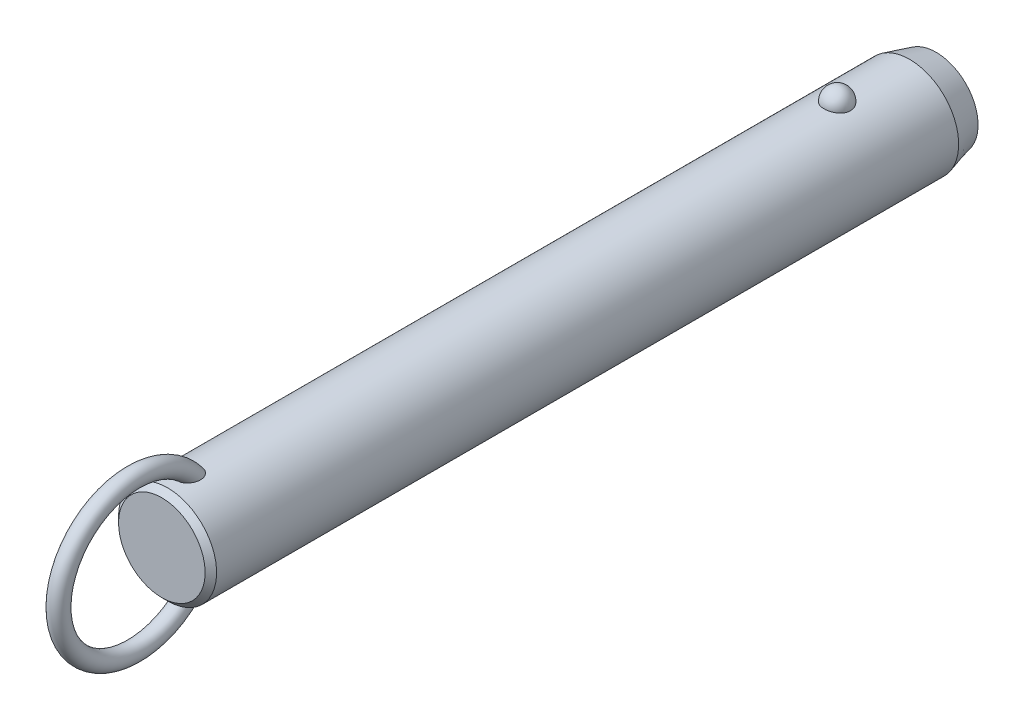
ISO-10303-21;
HEADER;
FILE_DESCRIPTION(('STEP AP214'),'2;1');
FILE_NAME('part.step','',(''),(''),'','','');
FILE_SCHEMA(('AUTOMOTIVE_DESIGN { 1 0 10303 214 1 1 1 1 }'));
ENDSEC;
DATA;
#1=APPLICATION_CONTEXT('core data for automotive mechanical design processes');
#2=APPLICATION_PROTOCOL_DEFINITION('international standard','automotive_design',2000,#1);
#3=PRODUCT_CONTEXT('',#1,'mechanical');
#4=PRODUCT('Part','Part','',(#3));
#5=PRODUCT_RELATED_PRODUCT_CATEGORY('part','',(#4));
#6=PRODUCT_DEFINITION_FORMATION('','',#4);
#7=PRODUCT_DEFINITION_CONTEXT('part definition',#1,'design');
#8=PRODUCT_DEFINITION('design','',#6,#7);
#9=PRODUCT_DEFINITION_SHAPE('','',#8);
#10=(LENGTH_UNIT() NAMED_UNIT(*) SI_UNIT(.MILLI.,.METRE.));
#11=(NAMED_UNIT(*) PLANE_ANGLE_UNIT() SI_UNIT($,.RADIAN.));
#12=(NAMED_UNIT(*) SI_UNIT($,.STERADIAN.) SOLID_ANGLE_UNIT());
#13=UNCERTAINTY_MEASURE_WITH_UNIT(LENGTH_MEASURE(1.E-05),#10,'distance_accuracy_value','');
#14=(GEOMETRIC_REPRESENTATION_CONTEXT(3) GLOBAL_UNCERTAINTY_ASSIGNED_CONTEXT((#13)) GLOBAL_UNIT_ASSIGNED_CONTEXT((#10,
#11,#12)) REPRESENTATION_CONTEXT('',''));
#15=CARTESIAN_POINT('',(0.,0.,0.));
#16=DIRECTION('',(0.,0.,1.));
#17=DIRECTION('',(1.,0.,0.));
#18=AXIS2_PLACEMENT_3D('',#15,#16,#17);
#19=CARTESIAN_POINT('',(0.,0.,137.2));
#20=DIRECTION('',(0.,0.,-1.));
#21=DIRECTION('',(-1.,0.,0.));
#22=AXIS2_PLACEMENT_3D('',#19,#20,#21);
#23=CYLINDRICAL_SURFACE('',#22,11.1);
#24=CARTESIAN_POINT('',(2.9724815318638,10.6945945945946,-3.));
#25=CARTESIAN_POINT('',(2.97247830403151,10.6945972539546,-2.83225059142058));
#26=CARTESIAN_POINT('',(2.95876598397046,10.6984356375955,-2.66445972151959));
#27=CARTESIAN_POINT('',(2.90424529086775,10.7133624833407,-2.33362381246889));
#28=CARTESIAN_POINT('',(2.8634252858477,10.7244540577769,-2.1705808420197));
#29=CARTESIAN_POINT('',(2.75573657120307,10.7526272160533,-1.85396767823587));
#30=CARTESIAN_POINT('',(2.68887937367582,10.7697061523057,-1.70039333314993));
#31=CARTESIAN_POINT('',(2.53079696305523,10.8079438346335,-1.40691598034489));
#32=CARTESIAN_POINT('',(2.43957264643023,10.8291024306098,-1.2670124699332));
#33=CARTESIAN_POINT('',(2.23458150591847,10.8732541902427,-1.00409565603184));
#34=CARTESIAN_POINT('',(2.12071295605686,10.8962553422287,-0.881162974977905));
#35=CARTESIAN_POINT('',(1.87365402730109,10.9414421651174,-0.656352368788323));
#36=CARTESIAN_POINT('',(1.74046358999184,10.9636278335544,-0.554474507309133));
#37=CARTESIAN_POINT('',(1.45872188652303,11.0046495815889,-0.374872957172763));
#38=CARTESIAN_POINT('',(1.31021276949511,11.0234944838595,-0.297085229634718));
#39=CARTESIAN_POINT('',(1.00170030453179,11.0557957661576,-0.167529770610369));
#40=CARTESIAN_POINT('',(0.841698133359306,11.0692526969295,-0.115759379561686));
#41=CARTESIAN_POINT('',(0.517607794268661,11.0890932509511,-0.0403925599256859));
#42=CARTESIAN_POINT('',(0.353633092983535,11.0955916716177,-0.0163383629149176));
#43=CARTESIAN_POINT('',(0.0238420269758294,11.1011989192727,0.0044517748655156));
#44=CARTESIAN_POINT('',(-0.141974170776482,11.1003084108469,0.00119017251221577));
#45=CARTESIAN_POINT('',(-0.468405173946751,11.0912990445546,-0.0323233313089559));
#46=CARTESIAN_POINT('',(-0.629059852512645,11.0832767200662,-0.0622147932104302));
#47=CARTESIAN_POINT('',(-0.942937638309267,11.0609962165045,-0.147645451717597));
#48=CARTESIAN_POINT('',(-1.09616062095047,11.0467379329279,-0.203185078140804));
#49=CARTESIAN_POINT('',(-1.39181061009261,11.0134071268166,-0.3387529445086));
#50=CARTESIAN_POINT('',(-1.53417383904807,10.9943086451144,-0.418913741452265));
#51=CARTESIAN_POINT('',(-1.80342160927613,10.9533667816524,-0.60144882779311));
#52=CARTESIAN_POINT('',(-1.9303046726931,10.9315231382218,-0.703825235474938));
#53=CARTESIAN_POINT('',(-2.16747598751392,10.887005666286,-0.930091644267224));
#54=CARTESIAN_POINT('',(-2.27742774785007,10.8643239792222,-1.05433291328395));
#55=CARTESIAN_POINT('',(-2.47517316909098,10.8209886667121,-1.31966633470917));
#56=CARTESIAN_POINT('',(-2.56296538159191,10.8003351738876,-1.46075958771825));
#57=CARTESIAN_POINT('',(-2.71500300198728,10.7631304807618,-1.75753646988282));
#58=CARTESIAN_POINT('',(-2.77898901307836,10.7466250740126,-1.91335887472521));
#59=CARTESIAN_POINT('',(-2.88046189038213,10.7198747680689,-2.2339152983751));
#60=CARTESIAN_POINT('',(-2.91794947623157,10.709629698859,-2.39864907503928));
#61=CARTESIAN_POINT('',(-2.96537819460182,10.6965949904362,-2.73165170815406));
#62=CARTESIAN_POINT('',(-2.97542891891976,10.693775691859,-2.89990378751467));
#63=CARTESIAN_POINT('',(-2.96804271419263,10.6958279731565,-3.235752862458));
#64=CARTESIAN_POINT('',(-2.95060646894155,10.7006993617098,-3.40334987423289));
#65=CARTESIAN_POINT('',(-2.88883358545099,10.71753912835,-3.73233906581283));
#66=CARTESIAN_POINT('',(-2.84462026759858,10.7294749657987,-3.89375610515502));
#67=CARTESIAN_POINT('',(-2.73050447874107,10.7590797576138,-4.20667949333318));
#68=CARTESIAN_POINT('',(-2.66060103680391,10.7767489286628,-4.35818546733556));
#69=CARTESIAN_POINT('',(-2.49642559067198,10.8159599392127,-4.6478542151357));
#70=CARTESIAN_POINT('',(-2.40203047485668,10.8375211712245,-4.78594458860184));
#71=CARTESIAN_POINT('',(-2.19143488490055,10.8820570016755,-5.0441038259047));
#72=CARTESIAN_POINT('',(-2.07523364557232,10.9050316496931,-5.16417205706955));
#73=CARTESIAN_POINT('',(-1.82361254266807,10.9499219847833,-5.38334833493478));
#74=CARTESIAN_POINT('',(-1.68812945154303,10.9718338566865,-5.48238464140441));
#75=CARTESIAN_POINT('',(-1.40191298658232,11.0120611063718,-5.65618873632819));
#76=CARTESIAN_POINT('',(-1.25118062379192,11.0303767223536,-5.73095813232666));
#77=CARTESIAN_POINT('',(-0.940570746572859,11.0611653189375,-5.85334725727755));
#78=CARTESIAN_POINT('',(-0.780821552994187,11.0737044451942,-5.90127578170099));
#79=CARTESIAN_POINT('',(-0.455204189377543,11.0918598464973,-5.96992976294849));
#80=CARTESIAN_POINT('',(-0.289336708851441,11.0974768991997,-5.99065827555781));
#81=CARTESIAN_POINT('',(0.0406846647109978,11.1011307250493,-6.00418773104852));
#82=CARTESIAN_POINT('',(0.204817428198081,11.099299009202,-5.99747318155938));
#83=CARTESIAN_POINT('',(0.5295530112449,11.088551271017,-5.9574031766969));
#84=CARTESIAN_POINT('',(0.69015594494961,11.0796354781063,-5.92404858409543));
#85=CARTESIAN_POINT('',(1.0027760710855,11.0557204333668,-5.83180084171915));
#86=CARTESIAN_POINT('',(1.15482001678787,11.0407414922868,-5.77299291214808));
#87=CARTESIAN_POINT('',(1.44678373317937,11.0062913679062,-5.63147366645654));
#88=CARTESIAN_POINT('',(1.58670279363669,10.9868199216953,-5.54876095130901));
#89=CARTESIAN_POINT('',(1.8527023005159,10.9451315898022,-5.36027644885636));
#90=CARTESIAN_POINT('',(1.97855158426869,10.9228788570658,-5.25418644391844));
#91=CARTESIAN_POINT('',(2.21080872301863,10.8782509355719,-5.02251354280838));
#92=CARTESIAN_POINT('',(2.31721312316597,10.8558757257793,-4.89692718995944));
#93=CARTESIAN_POINT('',(2.5094551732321,10.8130715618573,-4.62745408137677));
#94=CARTESIAN_POINT('',(2.59493284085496,10.7926798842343,-4.48330448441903));
#95=CARTESIAN_POINT('',(2.740862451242,10.7565495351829,-4.18236358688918));
#96=CARTESIAN_POINT('',(2.80132490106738,10.7408089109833,-4.02557762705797));
#97=CARTESIAN_POINT('',(2.88959070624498,10.7173718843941,-3.72475308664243));
#98=CARTESIAN_POINT('',(2.92062102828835,10.7088950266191,-3.58171216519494));
#99=CARTESIAN_POINT('',(2.96206765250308,10.6975052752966,-3.29245795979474));
#100=CARTESIAN_POINT('',(2.97248434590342,10.6945922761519,-3.14624473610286));
#101=CARTESIAN_POINT('',(2.9724815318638,10.6945945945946,-3.));
#102=B_SPLINE_CURVE_WITH_KNOTS('',3,(#24,#25,#26,#27,#28,#29,#30,#31,#32,#33,#34,#35,#36,#37,
#38,#39,#40,#41,#42,#43,#44,#45,#46,#47,#48,#49,#50,#51,#52,#53,#54,#55,#56,#57,#58,#59,#60,#61,
#62,#63,#64,#65,#66,#67,#68,#69,#70,#71,#72,#73,#74,#75,#76,#77,#78,#79,#80,#81,#82,#83,#84,#85,
#86,#87,#88,#89,#90,#91,#92,#93,#94,#95,#96,#97,#98,#99,#100,#101),.UNSPECIFIED.,.T.,.F.,(4,2,2,
2,2,2,2,2,2,2,2,2,2,2,2,2,2,2,2,2,2,2,2,2,2,2,2,2,2,2,2,2,2,2,2,2,2,2,4),(0.,0.502722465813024,
1.00566079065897,1.5083769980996,2.01107471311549,2.51608392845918,3.02109467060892,
3.52475118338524,4.02835620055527,4.523518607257,5.0186364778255,5.50715297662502,
5.9956776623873,6.48688002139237,6.97812923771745,7.47814366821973,7.9781907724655,
8.48353712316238,8.9888697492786,9.49218093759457,9.99547960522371,10.4964777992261,
10.997494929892,11.5010810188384,12.0046847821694,12.5099796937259,13.0152411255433,
13.5145635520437,14.0138298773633,14.5043200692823,14.9947943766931,15.4836390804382,
15.9725123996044,16.4685040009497,16.9645836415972,17.4686765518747,17.972557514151,
18.410841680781,18.849117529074),.UNSPECIFIED.);
#103=CARTESIAN_POINT('',(2.9724815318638,10.6945945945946,-3.));
#104=VERTEX_POINT('',#103);
#105=EDGE_CURVE('E41',#104,#104,#102,.T.);
#106=ORIENTED_EDGE('',*,*,#105,.T.);
#107=EDGE_LOOP('',(#106));
#108=FACE_BOUND('',#107,.T.);
#109=CARTESIAN_POINT('',(0.,0.,148.6));
#110=DIRECTION('',(0.,0.,1.));
#111=DIRECTION('',(1.,0.,0.));
#112=AXIS2_PLACEMENT_3D('',#109,#110,#111);
#113=CIRCLE('',#112,11.1);
#114=CARTESIAN_POINT('',(-11.1,0.,148.6));
#115=VERTEX_POINT('',#114);
#116=EDGE_CURVE('E10',#115,#115,#113,.F.);
#117=ORIENTED_EDGE('',*,*,#116,.T.);
#118=EDGE_LOOP('',(#117));
#119=FACE_BOUND('',#118,.T.);
#120=CARTESIAN_POINT('',(-0.564520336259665,-11.0856356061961,140.857815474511));
#121=CARTESIAN_POINT('',(-0.667202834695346,-11.0804062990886,140.891283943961));
#122=CARTESIAN_POINT('',(-0.766875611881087,-11.0738877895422,140.933835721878));
#123=CARTESIAN_POINT('',(-0.95728412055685,-11.0590576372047,141.035419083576));
#124=CARTESIAN_POINT('',(-1.04801616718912,-11.0507452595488,141.09445742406));
#125=CARTESIAN_POINT('',(-1.21800952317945,-11.0333016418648,141.226529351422));
#126=CARTESIAN_POINT('',(-1.2973080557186,-11.0241732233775,141.299515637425));
#127=CARTESIAN_POINT('',(-1.44337665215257,-11.0060026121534,141.457037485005));
#128=CARTESIAN_POINT('',(-1.51014622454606,-10.9969604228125,141.541573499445));
#129=CARTESIAN_POINT('',(-1.63454620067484,-10.9791841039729,141.725521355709));
#130=CARTESIAN_POINT('',(-1.69127003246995,-10.9705107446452,141.825549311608));
#131=CARTESIAN_POINT('',(-1.7898078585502,-10.9548648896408,142.032790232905));
#132=CARTESIAN_POINT('',(-1.83161214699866,-10.9478935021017,142.140007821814));
#133=CARTESIAN_POINT('',(-1.91557028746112,-10.9335803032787,142.405408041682));
#134=CARTESIAN_POINT('',(-1.95040620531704,-10.9273269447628,142.565980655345));
#135=CARTESIAN_POINT('',(-1.99388326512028,-10.9194709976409,142.890697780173));
#136=CARTESIAN_POINT('',(-2.00248051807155,-10.9178762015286,143.054847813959));
#137=CARTESIAN_POINT('',(-1.99551615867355,-10.9191578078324,143.424650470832));
#138=CARTESIAN_POINT('',(-1.9732206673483,-10.9232807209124,143.630191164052));
#139=CARTESIAN_POINT('',(-1.9152976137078,-10.9335244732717,143.933595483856));
#140=CARTESIAN_POINT('',(-1.89184575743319,-10.9376266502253,144.034088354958));
#141=CARTESIAN_POINT('',(-1.83700674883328,-10.9469720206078,144.232855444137));
#142=CARTESIAN_POINT('',(-1.80562070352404,-10.9522150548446,144.331129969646));
#143=CARTESIAN_POINT('',(-1.73463055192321,-10.9636837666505,144.525914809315));
#144=CARTESIAN_POINT('',(-1.69493416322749,-10.9699202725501,144.622390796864));
#145=CARTESIAN_POINT('',(-1.60745141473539,-10.9830806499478,144.811626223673));
#146=CARTESIAN_POINT('',(-1.55966150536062,-10.9900048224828,144.904384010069));
#147=CARTESIAN_POINT('',(-1.45591812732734,-11.0042280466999,145.084690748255));
#148=CARTESIAN_POINT('',(-1.40000013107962,-11.0115253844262,145.172260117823));
#149=CARTESIAN_POINT('',(-1.27937470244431,-11.0261911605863,145.341029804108));
#150=CARTESIAN_POINT('',(-1.21467835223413,-11.0335594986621,145.42223795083));
#151=CARTESIAN_POINT('',(-1.08218150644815,-11.0473027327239,145.569001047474));
#152=CARTESIAN_POINT('',(-1.01522633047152,-11.0537063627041,145.635309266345));
#153=CARTESIAN_POINT('',(-0.872952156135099,-11.065850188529,145.758378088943));
#154=CARTESIAN_POINT('',(-0.797642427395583,-11.0715911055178,145.815149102));
#155=CARTESIAN_POINT('',(-0.651396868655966,-11.081071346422,145.907515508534));
#156=CARTESIAN_POINT('',(-0.581712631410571,-11.0849841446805,145.945049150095));
#157=CARTESIAN_POINT('',(-0.437066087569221,-11.0916271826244,146.008259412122));
#158=CARTESIAN_POINT('',(-0.362109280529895,-11.0943586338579,146.033948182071));
#159=CARTESIAN_POINT('',(-0.207828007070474,-11.0983242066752,146.071117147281));
#160=CARTESIAN_POINT('',(-0.12846771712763,-11.0995432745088,146.082454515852));
#161=CARTESIAN_POINT('',(0.0309101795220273,-11.1002423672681,146.088965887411));
#162=CARTESIAN_POINT('',(0.110927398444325,-11.0997233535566,146.084148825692));
#163=CARTESIAN_POINT('',(0.25640659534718,-11.097240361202,146.060959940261));
#164=CARTESIAN_POINT('',(0.322235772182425,-11.0955074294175,146.044754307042));
#165=CARTESIAN_POINT('',(0.450635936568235,-11.0910350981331,146.002600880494));
#166=CARTESIAN_POINT('',(0.513205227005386,-11.0882951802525,145.976648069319));
#167=CARTESIAN_POINT('',(0.662626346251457,-11.0805620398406,145.902607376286));
#168=CARTESIAN_POINT('',(0.747127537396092,-11.0751144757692,145.849845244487));
#169=CARTESIAN_POINT('',(0.906756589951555,-11.0631932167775,145.731720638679));
#170=CARTESIAN_POINT('',(0.981859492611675,-11.0567168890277,145.666325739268));
#171=CARTESIAN_POINT('',(1.10712207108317,-11.0447856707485,145.54226337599));
#172=CARTESIAN_POINT('',(1.15909566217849,-11.0394280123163,145.485383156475));
#173=CARTESIAN_POINT('',(1.2579192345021,-11.0286040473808,145.367327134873));
#174=CARTESIAN_POINT('',(1.30476642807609,-11.0231376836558,145.306149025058));
#175=CARTESIAN_POINT('',(1.43818612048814,-11.0068027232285,145.117305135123));
#176=CARTESIAN_POINT('',(1.51751767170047,-10.9960104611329,144.984453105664));
#177=CARTESIAN_POINT('',(1.63597546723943,-10.9788847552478,144.753137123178));
#178=CARTESIAN_POINT('',(1.67988876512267,-10.9722190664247,144.657053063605));
#179=CARTESIAN_POINT('',(1.75953241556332,-10.9597298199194,144.461431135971));
#180=CARTESIAN_POINT('',(1.7952596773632,-10.9539065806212,144.361891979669));
#181=CARTESIAN_POINT('',(1.85844731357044,-10.9433632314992,144.16021118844));
#182=CARTESIAN_POINT('',(1.88591073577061,-10.9386427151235,144.05807052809));
#183=CARTESIAN_POINT('',(1.93234324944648,-10.9305350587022,143.851819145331));
#184=CARTESIAN_POINT('',(1.95131065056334,-10.9271481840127,143.747708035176));
#185=CARTESIAN_POINT('',(1.9904020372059,-10.9201183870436,143.465458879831));
#186=CARTESIAN_POINT('',(2.00221217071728,-10.9179256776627,143.286037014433));
#187=CARTESIAN_POINT('',(1.99711676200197,-10.9188636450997,142.927713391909));
#188=CARTESIAN_POINT('',(1.98026150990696,-10.9219849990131,142.748811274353));
#189=CARTESIAN_POINT('',(1.92151657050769,-10.9324473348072,142.43645144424));
#190=CARTESIAN_POINT('',(1.88605081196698,-10.9386915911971,142.301759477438));
#191=CARTESIAN_POINT('',(1.79393020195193,-10.9541780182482,142.039966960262));
#192=CARTESIAN_POINT('',(1.73729868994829,-10.9634168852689,141.912858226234));
#193=CARTESIAN_POINT('',(1.61237037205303,-10.9824218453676,141.689418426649));
#194=CARTESIAN_POINT('',(1.54715374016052,-10.9918945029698,141.591345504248));
#195=CARTESIAN_POINT('',(1.40127026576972,-11.0114415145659,141.407434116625));
#196=CARTESIAN_POINT('',(1.32060742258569,-11.0215157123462,141.321592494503));
#197=CARTESIAN_POINT('',(1.1447478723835,-11.041168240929,141.165163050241));
#198=CARTESIAN_POINT('',(1.04947805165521,-11.0507437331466,141.094656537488));
#199=CARTESIAN_POINT('',(0.847278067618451,-11.0680789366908,140.972640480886));
#200=CARTESIAN_POINT('',(0.740351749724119,-11.0758392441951,140.921124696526));
#201=CARTESIAN_POINT('',(0.529289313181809,-11.0878275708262,140.843485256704));
#202=CARTESIAN_POINT('',(0.425895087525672,-11.0923259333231,140.815377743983));
#203=CARTESIAN_POINT('',(0.215723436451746,-11.0984001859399,140.777703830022));
#204=CARTESIAN_POINT('',(0.10894793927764,-11.0999777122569,140.768127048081));
#205=CARTESIAN_POINT('',(-0.0938962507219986,-11.1000196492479,140.767877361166));
#206=CARTESIAN_POINT('',(-0.189967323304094,-11.0987797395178,140.775408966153));
#207=CARTESIAN_POINT('',(-0.379657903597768,-11.0939111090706,140.805507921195));
#208=CARTESIAN_POINT('',(-0.47327735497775,-11.0902823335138,140.828075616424));
#209=CARTESIAN_POINT('',(-0.564520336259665,-11.0856356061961,140.857815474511));
#210=B_SPLINE_CURVE_WITH_KNOTS('',3,(#120,#121,#122,#123,#124,#125,#126,#127,#128,#129,#130,
#131,#132,#133,#134,#135,#136,#137,#138,#139,#140,#141,#142,#143,#144,#145,#146,#147,#148,#149,
#150,#151,#152,#153,#154,#155,#156,#157,#158,#159,#160,#161,#162,#163,#164,#165,#166,#167,#168,
#169,#170,#171,#172,#173,#174,#175,#176,#177,#178,#179,#180,#181,#182,#183,#184,#185,#186,#187,
#188,#189,#190,#191,#192,#193,#194,#195,#196,#197,#198,#199,#200,#201,#202,#203,#204,#205,#206,
#207,#208,#209),.UNSPECIFIED.,.T.,.F.,(4,2,2,2,2,2,2,2,2,2,2,2,2,2,2,2,2,2,2,2,2,2,2,2,2,2,2,2,
2,2,2,2,2,2,2,2,2,2,2,2,2,2,2,2,4),(0.,0.323999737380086,0.64813245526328,0.971184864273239,
1.29424994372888,1.63886237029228,1.98369857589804,2.47426059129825,2.96564271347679,
3.58257396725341,3.89215258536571,4.20168803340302,4.51486273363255,4.82817514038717,
5.14015911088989,5.45175282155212,5.73442856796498,6.01679375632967,6.2536458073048,
6.49025437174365,6.72919963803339,6.96801276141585,7.17061258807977,7.37331685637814,
7.67094989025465,7.96935728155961,8.20075067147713,8.43226927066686,8.89581623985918,
9.21306533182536,9.53043400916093,9.84768549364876,10.1650000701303,10.7022930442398,
11.2386443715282,11.655339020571,12.071575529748,12.4245637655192,12.7774607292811,
13.1321855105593,13.4867936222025,13.8068771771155,14.1267813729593,14.4146787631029,
14.7025827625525),.UNSPECIFIED.);
#211=CARTESIAN_POINT('',(-0.564520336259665,-11.0856356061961,140.857815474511));
#212=VERTEX_POINT('',#211);
#213=EDGE_CURVE('E60',#212,#212,#210,.T.);
#214=ORIENTED_EDGE('',*,*,#213,.T.);
#215=EDGE_LOOP('',(#214));
#216=FACE_BOUND('',#215,.T.);
#217=CARTESIAN_POINT('',(-0.564520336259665,11.0856356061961,140.857815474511));
#218=CARTESIAN_POINT('',(-0.468542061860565,11.0905203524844,140.826545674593));
#219=CARTESIAN_POINT('',(-0.369793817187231,11.0942886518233,140.803157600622));
#220=CARTESIAN_POINT('',(-0.169555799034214,11.0991586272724,140.773085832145));
#221=CARTESIAN_POINT('',(-0.0680604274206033,11.1002543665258,140.76643932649));
#222=CARTESIAN_POINT('',(0.134549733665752,11.099646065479,140.770157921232));
#223=CARTESIAN_POINT('',(0.235664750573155,11.0979441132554,140.78051033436));
#224=CARTESIAN_POINT('',(0.434632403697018,11.0919342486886,140.817831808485));
#225=CARTESIAN_POINT('',(0.532486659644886,11.0876276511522,140.844792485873));
#226=CARTESIAN_POINT('',(0.722445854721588,11.0768742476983,140.9144096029));
#227=CARTESIAN_POINT('',(0.814543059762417,11.0704246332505,140.957086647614));
#228=CARTESIAN_POINT('',(0.990565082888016,11.0560659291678,141.056648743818));
#229=CARTESIAN_POINT('',(1.07448844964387,11.048156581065,141.113536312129));
#230=CARTESIAN_POINT('',(1.23562672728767,11.0313221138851,141.242210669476));
#231=CARTESIAN_POINT('',(1.3124268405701,11.0223686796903,141.314511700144));
#232=CARTESIAN_POINT('',(1.45398030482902,11.0045918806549,141.470042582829));
#233=CARTESIAN_POINT('',(1.51873073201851,10.9957685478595,141.553275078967));
#234=CARTESIAN_POINT('',(1.64107232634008,10.9782087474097,141.736384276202));
#235=CARTESIAN_POINT('',(1.6974317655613,10.9695572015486,141.837089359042));
#236=CARTESIAN_POINT('',(1.79515063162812,10.9539887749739,142.045626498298));
#237=CARTESIAN_POINT('',(1.83649966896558,10.9470730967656,142.15346343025));
#238=CARTESIAN_POINT('',(1.91931148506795,10.9329211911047,142.420399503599));
#239=CARTESIAN_POINT('',(1.95340104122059,10.9267904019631,142.581861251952));
#240=CARTESIAN_POINT('',(1.99526195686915,10.9192174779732,142.90821631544));
#241=CARTESIAN_POINT('',(2.00298989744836,10.9177830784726,143.07311484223));
#242=CARTESIAN_POINT('',(1.99396251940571,10.9194420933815,143.444100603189));
#243=CARTESIAN_POINT('',(1.97050829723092,10.923774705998,143.65003871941));
#244=CARTESIAN_POINT('',(1.91079643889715,10.9343131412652,143.953901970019));
#245=CARTESIAN_POINT('',(1.88673702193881,10.9385106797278,144.054529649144));
#246=CARTESIAN_POINT('',(1.8306550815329,10.9480376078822,144.253510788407));
#247=CARTESIAN_POINT('',(1.79863369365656,10.9533668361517,144.351864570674));
#248=CARTESIAN_POINT('',(1.72633365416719,10.9649954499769,144.546720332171));
#249=CARTESIAN_POINT('',(1.68596409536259,10.9713053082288,144.64318790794));
#250=CARTESIAN_POINT('',(1.59707998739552,10.9845964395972,144.832323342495));
#251=CARTESIAN_POINT('',(1.54856169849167,10.9915780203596,144.924989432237));
#252=CARTESIAN_POINT('',(1.44330168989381,11.0058935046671,145.104975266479));
#253=CARTESIAN_POINT('',(1.3865974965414,11.0132257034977,145.192316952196));
#254=CARTESIAN_POINT('',(1.2643115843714,11.0279330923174,145.360456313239));
#255=CARTESIAN_POINT('',(1.19874160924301,11.0353082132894,145.441262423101));
#256=CARTESIAN_POINT('',(1.06542088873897,11.048931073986,145.585985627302));
#257=CARTESIAN_POINT('',(0.998640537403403,11.0552153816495,145.650784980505));
#258=CARTESIAN_POINT('',(0.856896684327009,11.0671032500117,145.770846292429));
#259=CARTESIAN_POINT('',(0.781942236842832,11.0727075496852,145.826118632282));
#260=CARTESIAN_POINT('',(0.636276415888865,11.081949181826,145.915972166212));
#261=CARTESIAN_POINT('',(0.566755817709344,11.0857572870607,145.952441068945));
#262=CARTESIAN_POINT('',(0.422602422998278,11.0921860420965,146.013533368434));
#263=CARTESIAN_POINT('',(0.347974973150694,11.0948079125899,146.038168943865));
#264=CARTESIAN_POINT('',(0.194593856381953,11.0985608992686,146.073323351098));
#265=CARTESIAN_POINT('',(0.115807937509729,11.0996777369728,146.083706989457));
#266=CARTESIAN_POINT('',(-0.0422499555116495,11.1002003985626,146.088574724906));
#267=CARTESIAN_POINT('',(-0.121521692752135,11.09960699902,146.083066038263));
#268=CARTESIAN_POINT('',(-0.266046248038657,11.0970123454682,146.058827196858));
#269=CARTESIAN_POINT('',(-0.331661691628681,11.0952283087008,146.042135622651));
#270=CARTESIAN_POINT('',(-0.459588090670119,11.0906663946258,145.999111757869));
#271=CARTESIAN_POINT('',(-0.52189737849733,11.0878880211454,145.972774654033));
#272=CARTESIAN_POINT('',(-0.671446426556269,11.0800342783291,145.897513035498));
#273=CARTESIAN_POINT('',(-0.756250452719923,11.0744969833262,145.843818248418));
#274=CARTESIAN_POINT('',(-0.916349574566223,11.0624045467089,145.723802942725));
#275=CARTESIAN_POINT('',(-0.991618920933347,11.0558467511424,145.657449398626));
#276=CARTESIAN_POINT('',(-1.11713140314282,11.0437783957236,145.531633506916));
#277=CARTESIAN_POINT('',(-1.1692053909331,11.0383619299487,145.473952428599));
#278=CARTESIAN_POINT('',(-1.26817476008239,11.02743010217,145.354280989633));
#279=CARTESIAN_POINT('',(-1.31506731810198,11.0219146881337,145.292288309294));
#280=CARTESIAN_POINT('',(-1.40399813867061,11.0109399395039,145.164784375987));
#281=CARTESIAN_POINT('',(-1.44602864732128,11.0054807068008,145.099267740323));
#282=CARTESIAN_POINT('',(-1.52538779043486,10.9947621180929,144.965422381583));
#283=CARTESIAN_POINT('',(-1.56271516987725,10.9895028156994,144.897092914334));
#284=CARTESIAN_POINT('',(-1.64537943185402,10.9774790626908,144.733210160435));
#285=CARTESIAN_POINT('',(-1.68879497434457,10.9708503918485,144.6366735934));
#286=CARTESIAN_POINT('',(-1.76740738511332,10.9584602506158,144.440236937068));
#287=CARTESIAN_POINT('',(-1.80260120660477,10.95269910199,144.34033561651));
#288=CARTESIAN_POINT('',(-1.86468657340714,10.9423003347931,144.137966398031));
#289=CARTESIAN_POINT('',(-1.8915816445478,10.9376622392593,144.035499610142));
#290=CARTESIAN_POINT('',(-1.93682458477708,10.9297405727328,143.828642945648));
#291=CARTESIAN_POINT('',(-1.95517082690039,10.9264572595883,143.724252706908));
#292=CARTESIAN_POINT('',(-1.99232562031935,10.9197647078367,143.44262876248));
#293=CARTESIAN_POINT('',(-2.00294603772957,10.9177914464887,143.264185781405));
#294=CARTESIAN_POINT('',(-1.99566675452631,10.9191290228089,142.907996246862));
#295=CARTESIAN_POINT('',(-1.97781651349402,10.9224306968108,142.73024902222));
#296=CARTESIAN_POINT('',(-1.91747214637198,10.9331592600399,142.419792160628));
#297=CARTESIAN_POINT('',(-1.88131022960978,10.9395108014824,142.285825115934));
#298=CARTESIAN_POINT('',(-1.78790380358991,10.9551659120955,142.02559757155));
#299=CARTESIAN_POINT('',(-1.73068309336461,10.9644661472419,141.899328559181));
#300=CARTESIAN_POINT('',(-1.60475573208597,10.9835398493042,141.67741565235));
#301=CARTESIAN_POINT('',(-1.53908879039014,10.9930297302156,141.580026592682));
#302=CARTESIAN_POINT('',(-1.39238608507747,11.0125708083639,141.397525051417));
#303=CARTESIAN_POINT('',(-1.31135150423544,11.0226219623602,141.312411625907));
#304=CARTESIAN_POINT('',(-1.14382035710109,11.0411991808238,141.16529943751));
#305=CARTESIAN_POINT('',(-1.0585850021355,11.0497792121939,141.10186930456));
#306=CARTESIAN_POINT('',(-0.878723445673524,11.0655285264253,140.990250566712));
#307=CARTESIAN_POINT('',(-0.784123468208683,11.0727015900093,140.942020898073));
#308=CARTESIAN_POINT('',(-0.646163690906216,11.0812501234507,140.886023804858));
#309=CARTESIAN_POINT('',(-0.605595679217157,11.0835451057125,140.871197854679));
#310=CARTESIAN_POINT('',(-0.564520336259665,11.0856356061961,140.857815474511));
#311=B_SPLINE_CURVE_WITH_KNOTS('',3,(#217,#218,#219,#220,#221,#222,#223,#224,#225,#226,#227,
#228,#229,#230,#231,#232,#233,#234,#235,#236,#237,#238,#239,#240,#241,#242,#243,#244,#245,#246,
#247,#248,#249,#250,#251,#252,#253,#254,#255,#256,#257,#258,#259,#260,#261,#262,#263,#264,#265,
#266,#267,#268,#269,#270,#271,#272,#273,#274,#275,#276,#277,#278,#279,#280,#281,#282,#283,#284,
#285,#286,#287,#288,#289,#290,#291,#292,#293,#294,#295,#296,#297,#298,#299,#300,#301,#302,#303,
#304,#305,#306,#307,#308,#309,#310),.UNSPECIFIED.,.T.,.F.,(4,2,2,2,2,2,2,2,2,2,2,2,2,2,2,2,2,2,
2,2,2,2,2,2,2,2,2,2,2,2,2,2,2,2,2,2,2,2,2,2,2,2,2,2,2,2,4),(0.,0.303061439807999,
0.606795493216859,0.910302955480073,1.21365733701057,1.51741085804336,1.82121821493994,
2.13745205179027,2.45376252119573,2.79958678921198,3.14564996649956,3.63832391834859,
4.13180893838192,4.75031912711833,5.06071926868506,5.37107516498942,5.6850077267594,
5.99908475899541,6.31176519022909,6.62403542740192,6.90315673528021,7.18197194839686,
7.41687778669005,7.65154134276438,7.88841587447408,8.12518286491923,8.32752842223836,
8.52997509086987,8.82986421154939,9.13054668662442,9.36393502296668,9.59744991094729,
9.83133221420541,10.0652767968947,10.383032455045,10.7009056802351,11.0186436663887,
11.3364420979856,11.8705925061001,12.4038159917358,12.8189662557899,13.2336487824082,
13.5857049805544,13.9377340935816,14.2561354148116,14.5736690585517,14.7033687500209),.UNSPECIFIED.);
#312=CARTESIAN_POINT('',(-0.564520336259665,11.0856356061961,140.857815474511));
#313=VERTEX_POINT('',#312);
#314=EDGE_CURVE('E68',#313,#313,#311,.T.);
#315=ORIENTED_EDGE('',*,*,#314,.T.);
#316=EDGE_LOOP('',(#315));
#317=FACE_BOUND('',#316,.T.);
#318=CARTESIAN_POINT('',(0.,0.,-19.3999999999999));
#319=DIRECTION('',(0.,0.,-1.));
#320=DIRECTION('',(-1.,0.,0.));
#321=AXIS2_PLACEMENT_3D('',#318,#319,#320);
#322=CIRCLE('',#321,11.1);
#323=CARTESIAN_POINT('',(-11.1,0.,-19.3999999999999));
#324=VERTEX_POINT('',#323);
#325=EDGE_CURVE('E57',#324,#324,#322,.F.);
#326=ORIENTED_EDGE('',*,*,#325,.T.);
#327=EDGE_LOOP('',(#326));
#328=FACE_BOUND('',#327,.T.);
#329=ADVANCED_FACE('F37',(#108,#119,#216,#317,#328),#23,.T.);
#330=CARTESIAN_POINT('',(0.,0.,-25.4));
#331=DIRECTION('',(0.,0.,-1.));
#332=DIRECTION('',(-1.,0.,0.));
#333=AXIS2_PLACEMENT_3D('',#330,#331,#332);
#334=PLANE('',#333);
#335=CARTESIAN_POINT('',(0.,0.,-25.4));
#336=DIRECTION('',(0.,0.,-1.));
#337=DIRECTION('',(-1.,0.,0.));
#338=AXIS2_PLACEMENT_3D('',#335,#336,#337);
#339=CIRCLE('',#338,9.49230484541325);
#340=CARTESIAN_POINT('',(-9.49230484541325,0.,-25.4));
#341=VERTEX_POINT('',#340);
#342=EDGE_CURVE('E67',#341,#341,#339,.T.);
#343=ORIENTED_EDGE('',*,*,#342,.T.);
#344=EDGE_LOOP('',(#343));
#345=FACE_BOUND('',#344,.T.);
#346=ADVANCED_FACE('F86',(#345),#334,.T.);
#347=CARTESIAN_POINT('',(0.,0.,-25.4));
#348=DIRECTION('',(0.,0.,1.));
#349=DIRECTION('',(1.,0.,0.));
#350=AXIS2_PLACEMENT_3D('',#347,#348,#349);
#351=CONICAL_SURFACE('',#350,9.49230484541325,0.261799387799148);
#352=ORIENTED_EDGE('',*,*,#325,.F.);
#353=EDGE_LOOP('',(#352));
#354=FACE_BOUND('',#353,.T.);
#355=ORIENTED_EDGE('',*,*,#342,.F.);
#356=EDGE_LOOP('',(#355));
#357=FACE_BOUND('',#356,.T.);
#358=ADVANCED_FACE('F84',(#354,#357),#351,.T.);
#359=CARTESIAN_POINT('',(0.,0.,149.9));
#360=DIRECTION('',(0.,0.,1.));
#361=DIRECTION('',(1.,0.,0.));
#362=AXIS2_PLACEMENT_3D('',#359,#360,#361);
#363=PLANE('',#362);
#364=CARTESIAN_POINT('',(0.,0.,149.9));
#365=DIRECTION('',(0.,0.,1.));
#366=DIRECTION('',(1.,0.,0.));
#367=AXIS2_PLACEMENT_3D('',#364,#365,#366);
#368=CIRCLE('',#367,9.8);
#369=CARTESIAN_POINT('',(-9.80000000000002,0.,149.9));
#370=VERTEX_POINT('',#369);
#371=EDGE_CURVE('E50',#370,#370,#368,.T.);
#372=ORIENTED_EDGE('',*,*,#371,.T.);
#373=EDGE_LOOP('',(#372));
#374=FACE_BOUND('',#373,.T.);
#375=ADVANCED_FACE('F78',(#374),#363,.T.);
#376=CARTESIAN_POINT('',(0.,0.,156.25));
#377=DIRECTION('',(1.,0.,0.));
#378=DIRECTION('',(0.,0.,-1.));
#379=AXIS2_PLACEMENT_3D('',#376,#377,#378);
#380=TOROIDAL_SURFACE('',#379,17.05,2.);
#381=ORIENTED_EDGE('',*,*,#314,.F.);
#382=EDGE_LOOP('',(#381));
#383=FACE_BOUND('',#382,.T.);
#384=ORIENTED_EDGE('',*,*,#213,.F.);
#385=EDGE_LOOP('',(#384));
#386=FACE_BOUND('',#385,.T.);
#387=ADVANCED_FACE('F74',(#383,#386),#380,.T.);
#388=CARTESIAN_POINT('',(0.,0.,149.9));
#389=DIRECTION('',(0.,0.,-1.));
#390=DIRECTION('',(-1.,0.,0.));
#391=AXIS2_PLACEMENT_3D('',#388,#389,#390);
#392=CONICAL_SURFACE('',#391,9.8,0.785398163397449);
#393=CARTESIAN_POINT('',(-11.1,0.,148.6));
#394=CARTESIAN_POINT('',(-11.0864583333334,0.,148.613541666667));
#395=CARTESIAN_POINT('',(-11.0729166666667,0.,148.627083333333));
#396=CARTESIAN_POINT('',(-11.0458333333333,0.,148.654166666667));
#397=CARTESIAN_POINT('',(-11.0322916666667,0.,148.667708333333));
#398=CARTESIAN_POINT('',(-11.0052083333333,0.,148.694791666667));
#399=CARTESIAN_POINT('',(-10.9916666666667,0.,148.708333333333));
#400=CARTESIAN_POINT('',(-10.9645833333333,0.,148.735416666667));
#401=CARTESIAN_POINT('',(-10.9510416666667,0.,148.748958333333));
#402=CARTESIAN_POINT('',(-10.9239583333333,0.,148.776041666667));
#403=CARTESIAN_POINT('',(-10.9104166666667,0.,148.789583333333));
#404=CARTESIAN_POINT('',(-10.8833333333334,0.,148.816666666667));
#405=CARTESIAN_POINT('',(-10.8697916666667,0.,148.830208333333));
#406=CARTESIAN_POINT('',(-10.8427083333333,0.,148.857291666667));
#407=CARTESIAN_POINT('',(-10.8291666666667,0.,148.870833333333));
#408=CARTESIAN_POINT('',(-10.8020833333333,0.,148.897916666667));
#409=CARTESIAN_POINT('',(-10.7885416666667,0.,148.911458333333));
#410=CARTESIAN_POINT('',(-10.7614583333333,0.,148.938541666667));
#411=CARTESIAN_POINT('',(-10.7479166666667,0.,148.952083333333));
#412=CARTESIAN_POINT('',(-10.7208333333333,0.,148.979166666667));
#413=CARTESIAN_POINT('',(-10.7072916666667,0.,148.992708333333));
#414=CARTESIAN_POINT('',(-10.6802083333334,0.,149.019791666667));
#415=CARTESIAN_POINT('',(-10.6666666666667,0.,149.033333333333));
#416=CARTESIAN_POINT('',(-10.6395833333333,0.,149.060416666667));
#417=CARTESIAN_POINT('',(-10.6260416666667,0.,149.073958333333));
#418=CARTESIAN_POINT('',(-10.5989583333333,0.,149.101041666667));
#419=CARTESIAN_POINT('',(-10.5854166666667,0.,149.114583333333));
#420=CARTESIAN_POINT('',(-10.5583333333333,0.,149.141666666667));
#421=CARTESIAN_POINT('',(-10.5447916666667,0.,149.155208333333));
#422=CARTESIAN_POINT('',(-10.5177083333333,0.,149.182291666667));
#423=CARTESIAN_POINT('',(-10.5041666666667,0.,149.195833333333));
#424=CARTESIAN_POINT('',(-10.4770833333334,0.,149.222916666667));
#425=CARTESIAN_POINT('',(-10.4635416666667,0.,149.236458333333));
#426=CARTESIAN_POINT('',(-10.4364583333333,0.,149.263541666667));
#427=CARTESIAN_POINT('',(-10.4229166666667,0.,149.277083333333));
#428=CARTESIAN_POINT('',(-10.3958333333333,0.,149.304166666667));
#429=CARTESIAN_POINT('',(-10.3822916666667,0.,149.317708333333));
#430=CARTESIAN_POINT('',(-10.3552083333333,0.,149.344791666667));
#431=CARTESIAN_POINT('',(-10.3416666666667,0.,149.358333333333));
#432=CARTESIAN_POINT('',(-10.3145833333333,0.,149.385416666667));
#433=CARTESIAN_POINT('',(-10.3010416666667,0.,149.398958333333));
#434=CARTESIAN_POINT('',(-10.2739583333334,0.,149.426041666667));
#435=CARTESIAN_POINT('',(-10.2604166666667,0.,149.439583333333));
#436=CARTESIAN_POINT('',(-10.2333333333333,0.,149.466666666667));
#437=CARTESIAN_POINT('',(-10.2197916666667,0.,149.480208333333));
#438=CARTESIAN_POINT('',(-10.1927083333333,0.,149.507291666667));
#439=CARTESIAN_POINT('',(-10.1791666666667,0.,149.520833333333));
#440=CARTESIAN_POINT('',(-10.1520833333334,0.,149.547916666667));
#441=CARTESIAN_POINT('',(-10.1385416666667,0.,149.561458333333));
#442=CARTESIAN_POINT('',(-10.1114583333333,0.,149.588541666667));
#443=CARTESIAN_POINT('',(-10.0979166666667,0.,149.602083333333));
#444=CARTESIAN_POINT('',(-10.0708333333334,0.,149.629166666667));
#445=CARTESIAN_POINT('',(-10.0572916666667,0.,149.642708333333));
#446=CARTESIAN_POINT('',(-10.0302083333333,0.,149.669791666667));
#447=CARTESIAN_POINT('',(-10.0166666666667,0.,149.683333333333));
#448=CARTESIAN_POINT('',(-9.98958333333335,0.,149.710416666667));
#449=CARTESIAN_POINT('',(-9.97604166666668,0.,149.723958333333));
#450=CARTESIAN_POINT('',(-9.94895833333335,0.,149.751041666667));
#451=CARTESIAN_POINT('',(-9.93541666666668,0.,149.764583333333));
#452=CARTESIAN_POINT('',(-9.90833333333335,0.,149.791666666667));
#453=CARTESIAN_POINT('',(-9.89479166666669,0.,149.805208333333));
#454=CARTESIAN_POINT('',(-9.86770833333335,0.,149.832291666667));
#455=CARTESIAN_POINT('',(-9.85416666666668,0.,149.845833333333));
#456=CARTESIAN_POINT('',(-9.82708333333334,0.,149.872916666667));
#457=CARTESIAN_POINT('',(-9.81354166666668,0.,149.886458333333));
#458=CARTESIAN_POINT('',(-9.80000000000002,0.,149.9));
#459=B_SPLINE_CURVE_WITH_KNOTS('',3,(#393,#394,#395,#396,#397,#398,#399,#400,#401,#402,#403,
#404,#405,#406,#407,#408,#409,#410,#411,#412,#413,#414,#415,#416,#417,#418,#419,#420,#421,#422,
#423,#424,#425,#426,#427,#428,#429,#430,#431,#432,#433,#434,#435,#436,#437,#438,#439,#440,#441,
#442,#443,#444,#445,#446,#447,#448,#449,#450,#451,#452,#453,#454,#455,#456,#457,#458),
.UNSPECIFIED.,.F.,.F.,(4,2,2,2,2,2,2,2,2,2,2,2,2,2,2,2,2,2,2,2,2,2,2,2,2,2,2,2,2,2,2,2,4),(0.,
0.0574524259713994,0.114904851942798,0.172357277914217,0.229809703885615,0.287262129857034,
0.344714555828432,0.402166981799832,0.459619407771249,0.517071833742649,0.574524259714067,
0.631976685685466,0.689429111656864,0.746881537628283,0.804333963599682,0.861786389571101,
0.9192388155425,0.976691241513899,1.03414366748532,1.09159609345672,1.14904851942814,
1.20650094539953,1.26395337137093,1.32140579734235,1.37885822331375,1.43631064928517,
1.49376307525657,1.55121550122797,1.60866792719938,1.66612035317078,1.7235727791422,
1.7810252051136,1.83847763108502),.UNSPECIFIED.);
#460=EDGE_CURVE('BSEAM39',#115,#370,#459,.T.);
#461=ORIENTED_EDGE('',*,*,#116,.F.);
#462=ORIENTED_EDGE('',*,*,#371,.F.);
#463=ORIENTED_EDGE('',*,*,#460,.T.);
#464=ORIENTED_EDGE('',*,*,#460,.F.);
#465=EDGE_LOOP('',(#461,#463,#462,#464));
#466=FACE_BOUND('',#465,.T.);
#467=ADVANCED_FACE('F39',(#466),#392,.T.);
#468=CARTESIAN_POINT('',(0.,11.1,-3.));
#469=DIRECTION('',(0.,1.,0.));
#470=DIRECTION('',(0.,0.,-1.));
#471=AXIS2_PLACEMENT_3D('',#468,#469,#470);
#472=SPHERICAL_SURFACE('',#471,3.);
#473=ORIENTED_EDGE('',*,*,#105,.F.);
#474=EDGE_LOOP('',(#473));
#475=FACE_BOUND('',#474,.T.);
#476=ADVANCED_FACE('F80',(#475),#472,.T.);
#477=CLOSED_SHELL('',(#329,#346,#358,#375,#387,#467,#476));
#478=MANIFOLD_SOLID_BREP('B2',#477);
#479=ADVANCED_BREP_SHAPE_REPRESENTATION('',(#18,#478),#14);
#480=SHAPE_DEFINITION_REPRESENTATION(#9,#479);
ENDSEC;
END-ISO-10303-21;
